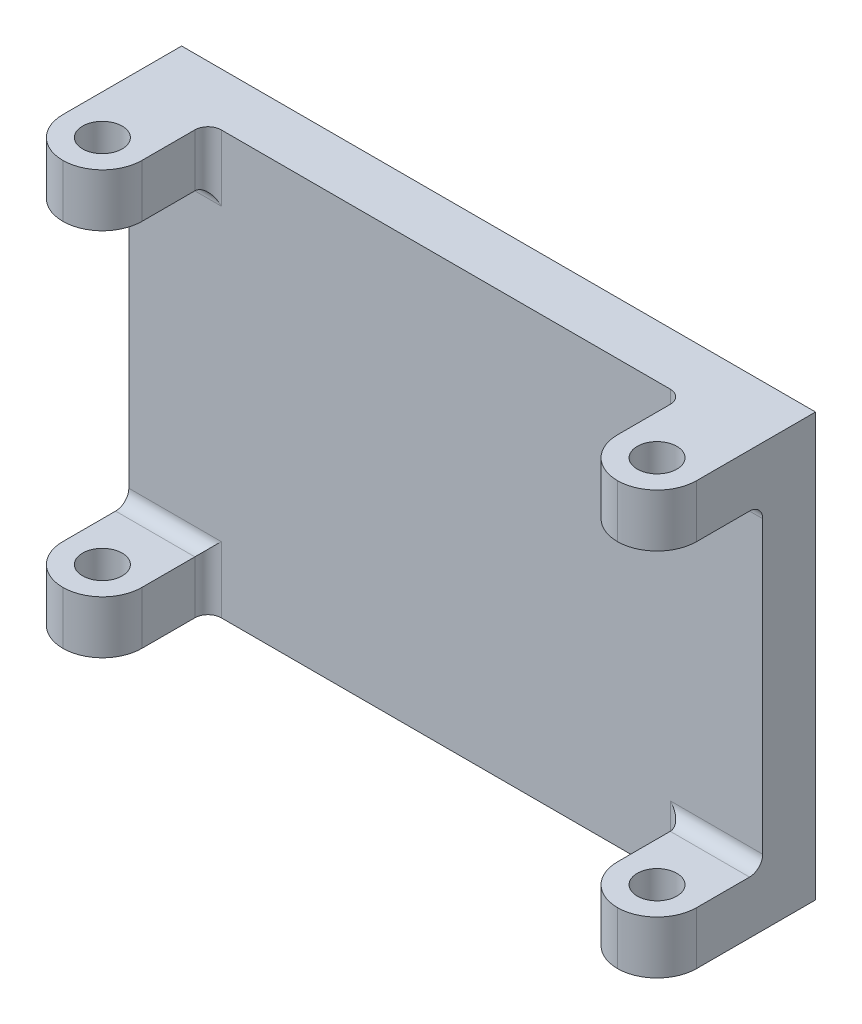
ISO-10303-21;
HEADER;
FILE_DESCRIPTION(('STEP AP214'),'2;1');
FILE_NAME('part.step','',(''),(''),'','','');
FILE_SCHEMA(('AUTOMOTIVE_DESIGN { 1 0 10303 214 1 1 1 1 }'));
ENDSEC;
DATA;
#1=APPLICATION_CONTEXT('core data for automotive mechanical design processes');
#2=APPLICATION_PROTOCOL_DEFINITION('international standard','automotive_design',2000,#1);
#3=PRODUCT_CONTEXT('',#1,'mechanical');
#4=PRODUCT('Part','Part','',(#3));
#5=PRODUCT_RELATED_PRODUCT_CATEGORY('part','',(#4));
#6=PRODUCT_DEFINITION_FORMATION('','',#4);
#7=PRODUCT_DEFINITION_CONTEXT('part definition',#1,'design');
#8=PRODUCT_DEFINITION('design','',#6,#7);
#9=PRODUCT_DEFINITION_SHAPE('','',#8);
#10=(LENGTH_UNIT() NAMED_UNIT(*) SI_UNIT(.MILLI.,.METRE.));
#11=(NAMED_UNIT(*) PLANE_ANGLE_UNIT() SI_UNIT($,.RADIAN.));
#12=(NAMED_UNIT(*) SI_UNIT($,.STERADIAN.) SOLID_ANGLE_UNIT());
#13=UNCERTAINTY_MEASURE_WITH_UNIT(LENGTH_MEASURE(1.E-05),#10,'distance_accuracy_value','');
#14=(GEOMETRIC_REPRESENTATION_CONTEXT(3) GLOBAL_UNCERTAINTY_ASSIGNED_CONTEXT((#13)) GLOBAL_UNIT_ASSIGNED_CONTEXT((#10,
#11,#12)) REPRESENTATION_CONTEXT('',''));
#15=CARTESIAN_POINT('',(0.,0.,0.));
#16=DIRECTION('',(0.,0.,1.));
#17=DIRECTION('',(1.,0.,0.));
#18=AXIS2_PLACEMENT_3D('',#15,#16,#17);
#19=CARTESIAN_POINT('',(-152.4,-101.6,25.4));
#20=DIRECTION('',(0.,0.,-1.));
#21=DIRECTION('',(-1.,0.,0.));
#22=AXIS2_PLACEMENT_3D('',#19,#20,#21);
#23=PLANE('',#22);
#24=DIRECTION('',(0.,1.,0.));
#25=VECTOR('',#24,1.);
#26=CARTESIAN_POINT('',(152.4,-101.6,25.4));
#27=LINE('',#26,#25);
#28=CARTESIAN_POINT('',(152.4,-69.85,25.4));
#29=VERTEX_POINT('',#28);
#30=CARTESIAN_POINT('',(152.4,69.85,25.4));
#31=VERTEX_POINT('',#30);
#32=EDGE_CURVE('E352',#29,#31,#27,.T.);
#33=ORIENTED_EDGE('',*,*,#32,.T.);
#34=DIRECTION('',(1.,0.,0.));
#35=VECTOR('',#34,1.);
#36=CARTESIAN_POINT('',(114.3,69.85,25.4));
#37=LINE('',#36,#35);
#38=CARTESIAN_POINT('',(107.95,69.85,25.4));
#39=VERTEX_POINT('',#38);
#40=EDGE_CURVE('E381',#31,#39,#37,.F.);
#41=ORIENTED_EDGE('',*,*,#40,.T.);
#42=DIRECTION('',(0.,-1.,0.));
#43=VECTOR('',#42,1.);
#44=CARTESIAN_POINT('',(107.95,101.6,25.4));
#45=LINE('',#44,#43);
#46=CARTESIAN_POINT('',(107.95,101.6,25.4));
#47=VERTEX_POINT('',#46);
#48=EDGE_CURVE('E373',#39,#47,#45,.F.);
#49=ORIENTED_EDGE('',*,*,#48,.T.);
#50=DIRECTION('',(-1.,0.,0.));
#51=VECTOR('',#50,1.);
#52=CARTESIAN_POINT('',(-152.4,101.6,25.4));
#53=LINE('',#52,#51);
#54=CARTESIAN_POINT('',(-107.95,101.6,25.4));
#55=VERTEX_POINT('',#54);
#56=EDGE_CURVE('E240',#47,#55,#53,.T.);
#57=ORIENTED_EDGE('',*,*,#56,.T.);
#58=DIRECTION('',(0.,-1.,0.));
#59=VECTOR('',#58,1.);
#60=CARTESIAN_POINT('',(-107.95,-101.6,25.4));
#61=LINE('',#60,#59);
#62=CARTESIAN_POINT('',(-107.95,69.85,25.4));
#63=VERTEX_POINT('',#62);
#64=EDGE_CURVE('E376',#55,#63,#61,.T.);
#65=ORIENTED_EDGE('',*,*,#64,.T.);
#66=DIRECTION('',(-1.,0.,0.));
#67=VECTOR('',#66,1.);
#68=CARTESIAN_POINT('',(-152.4,69.85,25.4));
#69=LINE('',#68,#67);
#70=CARTESIAN_POINT('',(-152.4,69.85,25.4));
#71=VERTEX_POINT('',#70);
#72=EDGE_CURVE('E371',#63,#71,#69,.T.);
#73=ORIENTED_EDGE('',*,*,#72,.T.);
#74=DIRECTION('',(0.,-1.,0.));
#75=VECTOR('',#74,1.);
#76=CARTESIAN_POINT('',(-152.4,-101.6,25.4));
#77=LINE('',#76,#75);
#78=CARTESIAN_POINT('',(-152.4,-69.85,25.4));
#79=VERTEX_POINT('',#78);
#80=EDGE_CURVE('E246',#71,#79,#77,.T.);
#81=ORIENTED_EDGE('',*,*,#80,.T.);
#82=DIRECTION('',(-1.,0.,0.));
#83=VECTOR('',#82,1.);
#84=CARTESIAN_POINT('',(-114.3,-69.85,25.4));
#85=LINE('',#84,#83);
#86=CARTESIAN_POINT('',(-107.95,-69.85,25.4));
#87=VERTEX_POINT('',#86);
#88=EDGE_CURVE('E458',#79,#87,#85,.F.);
#89=ORIENTED_EDGE('',*,*,#88,.T.);
#90=DIRECTION('',(0.,1.,0.));
#91=VECTOR('',#90,1.);
#92=CARTESIAN_POINT('',(-107.95,-101.6,25.4));
#93=LINE('',#92,#91);
#94=CARTESIAN_POINT('',(-107.95,-101.6,25.4));
#95=VERTEX_POINT('',#94);
#96=EDGE_CURVE('E341',#87,#95,#93,.F.);
#97=ORIENTED_EDGE('',*,*,#96,.T.);
#98=DIRECTION('',(1.,0.,0.));
#99=VECTOR('',#98,1.);
#100=CARTESIAN_POINT('',(-152.4,-101.6,25.4));
#101=LINE('',#100,#99);
#102=CARTESIAN_POINT('',(107.95,-101.6,25.4));
#103=VERTEX_POINT('',#102);
#104=EDGE_CURVE('E345',#95,#103,#101,.T.);
#105=ORIENTED_EDGE('',*,*,#104,.T.);
#106=DIRECTION('',(0.,1.,0.));
#107=VECTOR('',#106,1.);
#108=CARTESIAN_POINT('',(107.95,-101.6,25.4));
#109=LINE('',#108,#107);
#110=CARTESIAN_POINT('',(107.95,-69.85,25.4));
#111=VERTEX_POINT('',#110);
#112=EDGE_CURVE('E361',#103,#111,#109,.T.);
#113=ORIENTED_EDGE('',*,*,#112,.T.);
#114=DIRECTION('',(1.,0.,0.));
#115=VECTOR('',#114,1.);
#116=CARTESIAN_POINT('',(-152.4,-69.85,25.4));
#117=LINE('',#116,#115);
#118=EDGE_CURVE('E370',#111,#29,#117,.T.);
#119=ORIENTED_EDGE('',*,*,#118,.T.);
#120=EDGE_LOOP('',(#33,#41,#49,#57,#65,#73,#81,#89,#97,#105,#113,#119));
#121=FACE_BOUND('',#120,.T.);
#122=ADVANCED_FACE('F31',(#121),#23,.F.);
#123=CARTESIAN_POINT('',(-152.4,101.6,25.4));
#124=DIRECTION('',(0.,-1.,0.));
#125=DIRECTION('',(1.,0.,0.));
#126=AXIS2_PLACEMENT_3D('',#123,#124,#125);
#127=PLANE('',#126);
#128=CARTESIAN_POINT('',(133.35,101.6,57.15));
#129=DIRECTION('',(0.,1.,0.));
#130=DIRECTION('',(-1.,0.,0.));
#131=AXIS2_PLACEMENT_3D('',#128,#129,#130);
#132=CIRCLE('',#131,9.52500000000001);
#133=CARTESIAN_POINT('',(123.825,101.6,57.15));
#134=VERTEX_POINT('',#133);
#135=EDGE_CURVE('E338',#134,#134,#132,.T.);
#136=ORIENTED_EDGE('',*,*,#135,.F.);
#137=EDGE_LOOP('',(#136));
#138=FACE_BOUND('',#137,.T.);
#139=DIRECTION('',(0.,0.,-1.));
#140=VECTOR('',#139,1.);
#141=CARTESIAN_POINT('',(114.3,101.6,76.2));
#142=LINE('',#141,#140);
#143=CARTESIAN_POINT('',(114.3,101.6,57.15));
#144=VERTEX_POINT('',#143);
#145=CARTESIAN_POINT('',(114.3,101.6,31.75));
#146=VERTEX_POINT('',#145);
#147=EDGE_CURVE('E439',#144,#146,#142,.T.);
#148=ORIENTED_EDGE('',*,*,#147,.F.);
#149=CARTESIAN_POINT('',(133.35,101.6,57.15));
#150=DIRECTION('',(0.,-1.,0.));
#151=DIRECTION('',(1.,0.,0.));
#152=AXIS2_PLACEMENT_3D('',#149,#150,#151);
#153=CIRCLE('',#152,19.05);
#154=CARTESIAN_POINT('',(133.35,101.6,76.2));
#155=VERTEX_POINT('',#154);
#156=EDGE_CURVE('E326',#144,#155,#153,.F.);
#157=ORIENTED_EDGE('',*,*,#156,.T.);
#158=CARTESIAN_POINT('',(133.35,101.6,57.15));
#159=DIRECTION('',(0.,-1.,0.));
#160=DIRECTION('',(1.,0.,0.));
#161=AXIS2_PLACEMENT_3D('',#158,#159,#160);
#162=CIRCLE('',#161,19.05);
#163=CARTESIAN_POINT('',(152.4,101.6,57.15));
#164=VERTEX_POINT('',#163);
#165=EDGE_CURVE('E324',#155,#164,#162,.F.);
#166=ORIENTED_EDGE('',*,*,#165,.T.);
#167=DIRECTION('',(0.,0.,-1.));
#168=VECTOR('',#167,1.);
#169=CARTESIAN_POINT('',(152.4,101.6,25.4));
#170=LINE('',#169,#168);
#171=CARTESIAN_POINT('',(152.4,101.6,0.));
#172=VERTEX_POINT('',#171);
#173=EDGE_CURVE('E248',#164,#172,#170,.T.);
#174=ORIENTED_EDGE('',*,*,#173,.T.);
#175=DIRECTION('',(-1.,0.,0.));
#176=VECTOR('',#175,1.);
#177=CARTESIAN_POINT('',(-152.4,101.6,0.));
#178=LINE('',#177,#176);
#179=CARTESIAN_POINT('',(-152.4,101.6,0.));
#180=VERTEX_POINT('',#179);
#181=EDGE_CURVE('E244',#172,#180,#178,.T.);
#182=ORIENTED_EDGE('',*,*,#181,.T.);
#183=DIRECTION('',(0.,0.,-1.));
#184=VECTOR('',#183,1.);
#185=CARTESIAN_POINT('',(-152.4,101.6,25.4));
#186=LINE('',#185,#184);
#187=CARTESIAN_POINT('',(-152.4,101.6,57.15));
#188=VERTEX_POINT('',#187);
#189=EDGE_CURVE('E233',#188,#180,#186,.T.);
#190=ORIENTED_EDGE('',*,*,#189,.F.);
#191=CARTESIAN_POINT('',(-133.35,101.6,57.15));
#192=DIRECTION('',(0.,-1.,0.));
#193=DIRECTION('',(1.,0.,0.));
#194=AXIS2_PLACEMENT_3D('',#191,#192,#193);
#195=CIRCLE('',#194,19.05);
#196=CARTESIAN_POINT('',(-133.35,101.6,76.2));
#197=VERTEX_POINT('',#196);
#198=EDGE_CURVE('E303',#188,#197,#195,.F.);
#199=ORIENTED_EDGE('',*,*,#198,.T.);
#200=CARTESIAN_POINT('',(-133.35,101.6,57.15));
#201=DIRECTION('',(0.,-1.,0.));
#202=DIRECTION('',(1.,0.,0.));
#203=AXIS2_PLACEMENT_3D('',#200,#201,#202);
#204=CIRCLE('',#203,19.05);
#205=CARTESIAN_POINT('',(-114.3,101.6,57.15));
#206=VERTEX_POINT('',#205);
#207=EDGE_CURVE('E305',#197,#206,#204,.F.);
#208=ORIENTED_EDGE('',*,*,#207,.T.);
#209=DIRECTION('',(0.,0.,-1.));
#210=VECTOR('',#209,1.);
#211=CARTESIAN_POINT('',(-114.3,101.6,76.2));
#212=LINE('',#211,#210);
#213=CARTESIAN_POINT('',(-114.3,101.6,31.75));
#214=VERTEX_POINT('',#213);
#215=EDGE_CURVE('E313',#206,#214,#212,.T.);
#216=ORIENTED_EDGE('',*,*,#215,.T.);
#217=CARTESIAN_POINT('',(-107.95,101.6,31.75));
#218=DIRECTION('',(0.,-1.,0.));
#219=DIRECTION('',(1.,0.,0.));
#220=AXIS2_PLACEMENT_3D('',#217,#218,#219);
#221=CIRCLE('',#220,6.35);
#222=EDGE_CURVE('E40',#214,#55,#221,.T.);
#223=ORIENTED_EDGE('',*,*,#222,.T.);
#224=ORIENTED_EDGE('',*,*,#56,.F.);
#225=CARTESIAN_POINT('',(107.95,101.6,31.75));
#226=DIRECTION('',(0.,-1.,0.));
#227=DIRECTION('',(1.,0.,0.));
#228=AXIS2_PLACEMENT_3D('',#225,#226,#227);
#229=CIRCLE('',#228,6.35);
#230=EDGE_CURVE('E405',#47,#146,#229,.T.);
#231=ORIENTED_EDGE('',*,*,#230,.T.);
#232=EDGE_LOOP('',(#148,#157,#166,#174,#182,#190,#199,#208,#216,#223,#224,#231));
#233=FACE_BOUND('',#232,.T.);
#234=CARTESIAN_POINT('',(-133.35,101.6,57.15));
#235=DIRECTION('',(0.,-1.,0.));
#236=DIRECTION('',(1.,0.,0.));
#237=AXIS2_PLACEMENT_3D('',#234,#235,#236);
#238=CIRCLE('',#237,9.52500000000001);
#239=CARTESIAN_POINT('',(-123.825,101.6,57.15));
#240=VERTEX_POINT('',#239);
#241=EDGE_CURVE('E317',#240,#240,#238,.T.);
#242=ORIENTED_EDGE('',*,*,#241,.T.);
#243=EDGE_LOOP('',(#242));
#244=FACE_BOUND('',#243,.T.);
#245=ADVANCED_FACE('F450',(#138,#233,#244),#127,.F.);
#246=CARTESIAN_POINT('',(-152.4,76.2,76.2));
#247=DIRECTION('',(0.,-1.,0.));
#248=DIRECTION('',(0.,0.,-1.));
#249=AXIS2_PLACEMENT_3D('',#246,#247,#248);
#250=PLANE('',#249);
#251=DIRECTION('',(0.,0.,-1.));
#252=VECTOR('',#251,1.);
#253=CARTESIAN_POINT('',(-152.4,76.2,76.2));
#254=LINE('',#253,#252);
#255=CARTESIAN_POINT('',(-152.4,76.2,57.15));
#256=VERTEX_POINT('',#255);
#257=CARTESIAN_POINT('',(-152.4,76.2,31.75));
#258=VERTEX_POINT('',#257);
#259=EDGE_CURVE('E547',#256,#258,#254,.T.);
#260=ORIENTED_EDGE('',*,*,#259,.T.);
#261=DIRECTION('',(-1.,0.,0.));
#262=VECTOR('',#261,1.);
#263=CARTESIAN_POINT('',(-152.4,76.2,31.75));
#264=LINE('',#263,#262);
#265=CARTESIAN_POINT('',(-114.3,76.2,31.75));
#266=VERTEX_POINT('',#265);
#267=EDGE_CURVE('E383',#258,#266,#264,.F.);
#268=ORIENTED_EDGE('',*,*,#267,.T.);
#269=DIRECTION('',(0.,0.,-1.));
#270=VECTOR('',#269,1.);
#271=CARTESIAN_POINT('',(-114.3,76.2,76.2));
#272=LINE('',#271,#270);
#273=CARTESIAN_POINT('',(-114.3,76.2,57.15));
#274=VERTEX_POINT('',#273);
#275=EDGE_CURVE('E550',#274,#266,#272,.T.);
#276=ORIENTED_EDGE('',*,*,#275,.F.);
#277=CARTESIAN_POINT('',(-133.35,76.2,57.15));
#278=DIRECTION('',(0.,-1.,0.));
#279=DIRECTION('',(0.,0.,-1.));
#280=AXIS2_PLACEMENT_3D('',#277,#278,#279);
#281=CIRCLE('',#280,19.05);
#282=CARTESIAN_POINT('',(-133.35,76.2,76.2));
#283=VERTEX_POINT('',#282);
#284=EDGE_CURVE('E301',#274,#283,#281,.T.);
#285=ORIENTED_EDGE('',*,*,#284,.T.);
#286=CARTESIAN_POINT('',(-133.35,76.2,57.15));
#287=DIRECTION('',(0.,-1.,0.));
#288=DIRECTION('',(0.,0.,-1.));
#289=AXIS2_PLACEMENT_3D('',#286,#287,#288);
#290=CIRCLE('',#289,19.05);
#291=EDGE_CURVE('E299',#283,#256,#290,.T.);
#292=ORIENTED_EDGE('',*,*,#291,.T.);
#293=EDGE_LOOP('',(#260,#268,#276,#285,#292));
#294=FACE_BOUND('',#293,.T.);
#295=CARTESIAN_POINT('',(-133.35,76.2,57.15));
#296=DIRECTION('',(0.,-1.,0.));
#297=DIRECTION('',(0.,0.,-1.));
#298=AXIS2_PLACEMENT_3D('',#295,#296,#297);
#299=CIRCLE('',#298,9.52500000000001);
#300=CARTESIAN_POINT('',(-133.35,76.2,47.625));
#301=VERTEX_POINT('',#300);
#302=EDGE_CURVE('E314',#301,#301,#299,.F.);
#303=ORIENTED_EDGE('',*,*,#302,.T.);
#304=EDGE_LOOP('',(#303));
#305=FACE_BOUND('',#304,.T.);
#306=ADVANCED_FACE('F501',(#294,#305),#250,.T.);
#307=CARTESIAN_POINT('',(-152.4,-101.6,25.4));
#308=DIRECTION('',(0.,1.,0.));
#309=DIRECTION('',(-1.,0.,0.));
#310=AXIS2_PLACEMENT_3D('',#307,#308,#309);
#311=PLANE('',#310);
#312=CARTESIAN_POINT('',(133.35,-101.6,57.15));
#313=DIRECTION('',(0.,1.,0.));
#314=DIRECTION('',(-1.,0.,0.));
#315=AXIS2_PLACEMENT_3D('',#312,#313,#314);
#316=CIRCLE('',#315,19.05);
#317=CARTESIAN_POINT('',(152.4,-101.6,57.15));
#318=VERTEX_POINT('',#317);
#319=CARTESIAN_POINT('',(133.35,-101.6,76.2));
#320=VERTEX_POINT('',#319);
#321=EDGE_CURVE('E282',#318,#320,#316,.F.);
#322=ORIENTED_EDGE('',*,*,#321,.T.);
#323=CARTESIAN_POINT('',(133.35,-101.6,57.15));
#324=DIRECTION('',(0.,1.,0.));
#325=DIRECTION('',(-1.,0.,0.));
#326=AXIS2_PLACEMENT_3D('',#323,#324,#325);
#327=CIRCLE('',#326,19.05);
#328=CARTESIAN_POINT('',(114.3,-101.6,57.15));
#329=VERTEX_POINT('',#328);
#330=EDGE_CURVE('E284',#320,#329,#327,.F.);
#331=ORIENTED_EDGE('',*,*,#330,.T.);
#332=DIRECTION('',(0.,0.,-1.));
#333=VECTOR('',#332,1.);
#334=CARTESIAN_POINT('',(114.3,-101.6,76.2));
#335=LINE('',#334,#333);
#336=CARTESIAN_POINT('',(114.3,-101.6,31.75));
#337=VERTEX_POINT('',#336);
#338=EDGE_CURVE('E292',#329,#337,#335,.T.);
#339=ORIENTED_EDGE('',*,*,#338,.T.);
#340=CARTESIAN_POINT('',(107.95,-101.6,31.75));
#341=DIRECTION('',(0.,1.,0.));
#342=DIRECTION('',(-1.,0.,0.));
#343=AXIS2_PLACEMENT_3D('',#340,#341,#342);
#344=CIRCLE('',#343,6.35);
#345=EDGE_CURVE('E367',#337,#103,#344,.T.);
#346=ORIENTED_EDGE('',*,*,#345,.T.);
#347=ORIENTED_EDGE('',*,*,#104,.F.);
#348=CARTESIAN_POINT('',(-107.95,-101.6,31.75));
#349=DIRECTION('',(0.,1.,0.));
#350=DIRECTION('',(-1.,0.,0.));
#351=AXIS2_PLACEMENT_3D('',#348,#349,#350);
#352=CIRCLE('',#351,6.35);
#353=CARTESIAN_POINT('',(-114.3,-101.6,31.75));
#354=VERTEX_POINT('',#353);
#355=EDGE_CURVE('E11',#95,#354,#352,.T.);
#356=ORIENTED_EDGE('',*,*,#355,.T.);
#357=DIRECTION('',(0.,0.,-1.));
#358=VECTOR('',#357,1.);
#359=CARTESIAN_POINT('',(-114.3,-101.6,76.2));
#360=LINE('',#359,#358);
#361=CARTESIAN_POINT('',(-114.3,-101.6,57.15));
#362=VERTEX_POINT('',#361);
#363=EDGE_CURVE('E235',#362,#354,#360,.T.);
#364=ORIENTED_EDGE('',*,*,#363,.F.);
#365=CARTESIAN_POINT('',(-133.35,-101.6,57.15));
#366=DIRECTION('',(0.,1.,0.));
#367=DIRECTION('',(-1.,0.,0.));
#368=AXIS2_PLACEMENT_3D('',#365,#366,#367);
#369=CIRCLE('',#368,19.05);
#370=CARTESIAN_POINT('',(-133.35,-101.6,76.2));
#371=VERTEX_POINT('',#370);
#372=EDGE_CURVE('E263',#362,#371,#369,.F.);
#373=ORIENTED_EDGE('',*,*,#372,.T.);
#374=CARTESIAN_POINT('',(-133.35,-101.6,57.15));
#375=DIRECTION('',(0.,1.,0.));
#376=DIRECTION('',(-1.,0.,0.));
#377=AXIS2_PLACEMENT_3D('',#374,#375,#376);
#378=CIRCLE('',#377,19.05);
#379=CARTESIAN_POINT('',(-152.4,-101.6,57.15));
#380=VERTEX_POINT('',#379);
#381=EDGE_CURVE('E215',#371,#380,#378,.F.);
#382=ORIENTED_EDGE('',*,*,#381,.T.);
#383=DIRECTION('',(0.,0.,-1.));
#384=VECTOR('',#383,1.);
#385=CARTESIAN_POINT('',(-152.4,-101.6,25.4));
#386=LINE('',#385,#384);
#387=CARTESIAN_POINT('',(-152.4,-101.6,0.));
#388=VERTEX_POINT('',#387);
#389=EDGE_CURVE('E207',#380,#388,#386,.T.);
#390=ORIENTED_EDGE('',*,*,#389,.T.);
#391=DIRECTION('',(1.,0.,0.));
#392=VECTOR('',#391,1.);
#393=CARTESIAN_POINT('',(-152.4,-101.6,0.));
#394=LINE('',#393,#392);
#395=CARTESIAN_POINT('',(152.4,-101.6,0.));
#396=VERTEX_POINT('',#395);
#397=EDGE_CURVE('E212',#388,#396,#394,.T.);
#398=ORIENTED_EDGE('',*,*,#397,.T.);
#399=DIRECTION('',(0.,0.,-1.));
#400=VECTOR('',#399,1.);
#401=CARTESIAN_POINT('',(152.4,-101.6,25.4));
#402=LINE('',#401,#400);
#403=EDGE_CURVE('E220',#318,#396,#402,.T.);
#404=ORIENTED_EDGE('',*,*,#403,.F.);
#405=EDGE_LOOP('',(#322,#331,#339,#346,#347,#356,#364,#373,#382,#390,#398,#404));
#406=FACE_BOUND('',#405,.T.);
#407=CARTESIAN_POINT('',(-133.35,-101.6,57.15));
#408=DIRECTION('',(0.,-1.,0.));
#409=DIRECTION('',(1.,0.,0.));
#410=AXIS2_PLACEMENT_3D('',#407,#408,#409);
#411=CIRCLE('',#410,9.52500000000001);
#412=CARTESIAN_POINT('',(-123.825,-101.6,57.15));
#413=VERTEX_POINT('',#412);
#414=EDGE_CURVE('E275',#413,#413,#411,.T.);
#415=ORIENTED_EDGE('',*,*,#414,.F.);
#416=EDGE_LOOP('',(#415));
#417=FACE_BOUND('',#416,.T.);
#418=CARTESIAN_POINT('',(133.35,-101.6,57.15));
#419=DIRECTION('',(0.,1.,0.));
#420=DIRECTION('',(-1.,0.,0.));
#421=AXIS2_PLACEMENT_3D('',#418,#419,#420);
#422=CIRCLE('',#421,9.52500000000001);
#423=CARTESIAN_POINT('',(123.825,-101.6,57.15));
#424=VERTEX_POINT('',#423);
#425=EDGE_CURVE('E296',#424,#424,#422,.T.);
#426=ORIENTED_EDGE('',*,*,#425,.T.);
#427=EDGE_LOOP('',(#426));
#428=FACE_BOUND('',#427,.T.);
#429=ADVANCED_FACE('F209',(#406,#417,#428),#311,.F.);
#430=CARTESIAN_POINT('',(152.4,-76.2,76.2));
#431=DIRECTION('',(0.,1.,0.));
#432=DIRECTION('',(0.,0.,1.));
#433=AXIS2_PLACEMENT_3D('',#430,#431,#432);
#434=PLANE('',#433);
#435=DIRECTION('',(0.,0.,-1.));
#436=VECTOR('',#435,1.);
#437=CARTESIAN_POINT('',(152.4,-76.2,76.2));
#438=LINE('',#437,#436);
#439=CARTESIAN_POINT('',(152.4,-76.2,57.15));
#440=VERTEX_POINT('',#439);
#441=CARTESIAN_POINT('',(152.4,-76.2,31.75));
#442=VERTEX_POINT('',#441);
#443=EDGE_CURVE('E537',#440,#442,#438,.T.);
#444=ORIENTED_EDGE('',*,*,#443,.T.);
#445=DIRECTION('',(1.,0.,0.));
#446=VECTOR('',#445,1.);
#447=CARTESIAN_POINT('',(152.4,-76.2,31.75));
#448=LINE('',#447,#446);
#449=CARTESIAN_POINT('',(114.3,-76.2,31.75));
#450=VERTEX_POINT('',#449);
#451=EDGE_CURVE('E388',#442,#450,#448,.F.);
#452=ORIENTED_EDGE('',*,*,#451,.T.);
#453=DIRECTION('',(0.,0.,-1.));
#454=VECTOR('',#453,1.);
#455=CARTESIAN_POINT('',(114.3,-76.2,76.2));
#456=LINE('',#455,#454);
#457=CARTESIAN_POINT('',(114.3,-76.2,57.15));
#458=VERTEX_POINT('',#457);
#459=EDGE_CURVE('E538',#458,#450,#456,.T.);
#460=ORIENTED_EDGE('',*,*,#459,.F.);
#461=CARTESIAN_POINT('',(133.35,-76.2,57.15));
#462=DIRECTION('',(0.,1.,0.));
#463=DIRECTION('',(0.,0.,1.));
#464=AXIS2_PLACEMENT_3D('',#461,#462,#463);
#465=CIRCLE('',#464,19.05);
#466=CARTESIAN_POINT('',(133.35,-76.2,76.2));
#467=VERTEX_POINT('',#466);
#468=EDGE_CURVE('E280',#458,#467,#465,.T.);
#469=ORIENTED_EDGE('',*,*,#468,.T.);
#470=CARTESIAN_POINT('',(133.35,-76.2,57.15));
#471=DIRECTION('',(0.,1.,0.));
#472=DIRECTION('',(0.,0.,1.));
#473=AXIS2_PLACEMENT_3D('',#470,#471,#472);
#474=CIRCLE('',#473,19.05);
#475=EDGE_CURVE('E278',#467,#440,#474,.T.);
#476=ORIENTED_EDGE('',*,*,#475,.T.);
#477=EDGE_LOOP('',(#444,#452,#460,#469,#476));
#478=FACE_BOUND('',#477,.T.);
#479=CARTESIAN_POINT('',(133.35,-76.2,57.15));
#480=DIRECTION('',(0.,1.,0.));
#481=DIRECTION('',(0.,0.,1.));
#482=AXIS2_PLACEMENT_3D('',#479,#480,#481);
#483=CIRCLE('',#482,9.52500000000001);
#484=CARTESIAN_POINT('',(133.35,-76.2,66.675));
#485=VERTEX_POINT('',#484);
#486=EDGE_CURVE('E293',#485,#485,#483,.F.);
#487=ORIENTED_EDGE('',*,*,#486,.T.);
#488=EDGE_LOOP('',(#487));
#489=FACE_BOUND('',#488,.T.);
#490=ADVANCED_FACE('F512',(#478,#489),#434,.T.);
#491=CARTESIAN_POINT('',(-152.4,-101.6,25.4));
#492=DIRECTION('',(1.,0.,0.));
#493=DIRECTION('',(0.,0.,-1.));
#494=AXIS2_PLACEMENT_3D('',#491,#492,#493);
#495=PLANE('',#494);
#496=ORIENTED_EDGE('',*,*,#259,.F.);
#497=DIRECTION('',(0.,1.,0.));
#498=VECTOR('',#497,1.);
#499=CARTESIAN_POINT('',(-152.4,-101.6,57.15));
#500=LINE('',#499,#498);
#501=EDGE_CURVE('E307',#256,#188,#500,.T.);
#502=ORIENTED_EDGE('',*,*,#501,.T.);
#503=ORIENTED_EDGE('',*,*,#189,.T.);
#504=DIRECTION('',(0.,-1.,0.));
#505=VECTOR('',#504,1.);
#506=CARTESIAN_POINT('',(-152.4,-101.6,0.));
#507=LINE('',#506,#505);
#508=EDGE_CURVE('E226',#180,#388,#507,.T.);
#509=ORIENTED_EDGE('',*,*,#508,.T.);
#510=ORIENTED_EDGE('',*,*,#389,.F.);
#511=DIRECTION('',(0.,-1.,0.));
#512=VECTOR('',#511,1.);
#513=CARTESIAN_POINT('',(-152.4,-101.6,57.15));
#514=LINE('',#513,#512);
#515=CARTESIAN_POINT('',(-152.4,-76.2,57.15));
#516=VERTEX_POINT('',#515);
#517=EDGE_CURVE('E265',#380,#516,#514,.F.);
#518=ORIENTED_EDGE('',*,*,#517,.T.);
#519=DIRECTION('',(0.,0.,-1.));
#520=VECTOR('',#519,1.);
#521=CARTESIAN_POINT('',(-152.4,-76.2,76.2));
#522=LINE('',#521,#520);
#523=CARTESIAN_POINT('',(-152.4,-76.2,31.75));
#524=VERTEX_POINT('',#523);
#525=EDGE_CURVE('E271',#516,#524,#522,.T.);
#526=ORIENTED_EDGE('',*,*,#525,.T.);
#527=CARTESIAN_POINT('',(-152.4,-69.85,31.75));
#528=DIRECTION('',(1.,0.,0.));
#529=DIRECTION('',(0.,0.,-1.));
#530=AXIS2_PLACEMENT_3D('',#527,#528,#529);
#531=CIRCLE('',#530,6.35);
#532=EDGE_CURVE('E397',#524,#79,#531,.T.);
#533=ORIENTED_EDGE('',*,*,#532,.T.);
#534=ORIENTED_EDGE('',*,*,#80,.F.);
#535=CARTESIAN_POINT('',(-152.4,69.85,31.75));
#536=DIRECTION('',(1.,0.,0.));
#537=DIRECTION('',(0.,0.,-1.));
#538=AXIS2_PLACEMENT_3D('',#535,#536,#537);
#539=CIRCLE('',#538,6.35);
#540=EDGE_CURVE('E399',#71,#258,#539,.T.);
#541=ORIENTED_EDGE('',*,*,#540,.T.);
#542=EDGE_LOOP('',(#496,#502,#503,#509,#510,#518,#526,#533,#534,#541));
#543=FACE_BOUND('',#542,.T.);
#544=ADVANCED_FACE('F231',(#543),#495,.F.);
#545=CARTESIAN_POINT('',(152.4,-101.6,25.4));
#546=DIRECTION('',(-1.,0.,0.));
#547=DIRECTION('',(0.,0.,1.));
#548=AXIS2_PLACEMENT_3D('',#545,#546,#547);
#549=PLANE('',#548);
#550=ORIENTED_EDGE('',*,*,#173,.F.);
#551=DIRECTION('',(0.,1.,0.));
#552=VECTOR('',#551,1.);
#553=CARTESIAN_POINT('',(152.4,-101.6,57.15));
#554=LINE('',#553,#552);
#555=CARTESIAN_POINT('',(152.4,76.2,57.15));
#556=VERTEX_POINT('',#555);
#557=EDGE_CURVE('E328',#164,#556,#554,.F.);
#558=ORIENTED_EDGE('',*,*,#557,.T.);
#559=DIRECTION('',(0.,0.,-1.));
#560=VECTOR('',#559,1.);
#561=CARTESIAN_POINT('',(152.4,76.2,76.2));
#562=LINE('',#561,#560);
#563=CARTESIAN_POINT('',(152.4,76.2,31.75));
#564=VERTEX_POINT('',#563);
#565=EDGE_CURVE('E334',#556,#564,#562,.T.);
#566=ORIENTED_EDGE('',*,*,#565,.T.);
#567=CARTESIAN_POINT('',(152.4,69.85,31.75));
#568=DIRECTION('',(-1.,0.,0.));
#569=DIRECTION('',(0.,0.,1.));
#570=AXIS2_PLACEMENT_3D('',#567,#568,#569);
#571=CIRCLE('',#570,6.35);
#572=EDGE_CURVE('E401',#564,#31,#571,.T.);
#573=ORIENTED_EDGE('',*,*,#572,.T.);
#574=ORIENTED_EDGE('',*,*,#32,.F.);
#575=CARTESIAN_POINT('',(152.4,-69.85,31.75));
#576=DIRECTION('',(-1.,0.,0.));
#577=DIRECTION('',(0.,0.,1.));
#578=AXIS2_PLACEMENT_3D('',#575,#576,#577);
#579=CIRCLE('',#578,6.35);
#580=EDGE_CURVE('E403',#29,#442,#579,.T.);
#581=ORIENTED_EDGE('',*,*,#580,.T.);
#582=ORIENTED_EDGE('',*,*,#443,.F.);
#583=DIRECTION('',(0.,-1.,0.));
#584=VECTOR('',#583,1.);
#585=CARTESIAN_POINT('',(152.4,-101.6,57.15));
#586=LINE('',#585,#584);
#587=EDGE_CURVE('E286',#440,#318,#586,.T.);
#588=ORIENTED_EDGE('',*,*,#587,.T.);
#589=ORIENTED_EDGE('',*,*,#403,.T.);
#590=DIRECTION('',(0.,1.,0.));
#591=VECTOR('',#590,1.);
#592=CARTESIAN_POINT('',(152.4,-101.6,0.));
#593=LINE('',#592,#591);
#594=EDGE_CURVE('E228',#396,#172,#593,.T.);
#595=ORIENTED_EDGE('',*,*,#594,.T.);
#596=EDGE_LOOP('',(#550,#558,#566,#573,#574,#581,#582,#588,#589,#595));
#597=FACE_BOUND('',#596,.T.);
#598=ADVANCED_FACE('F424',(#597),#549,.F.);
#599=CARTESIAN_POINT('',(-152.4,-101.6,0.));
#600=DIRECTION('',(0.,0.,-1.));
#601=DIRECTION('',(-1.,0.,0.));
#602=AXIS2_PLACEMENT_3D('',#599,#600,#601);
#603=PLANE('',#602);
#604=ORIENTED_EDGE('',*,*,#508,.F.);
#605=ORIENTED_EDGE('',*,*,#181,.F.);
#606=ORIENTED_EDGE('',*,*,#594,.F.);
#607=ORIENTED_EDGE('',*,*,#397,.F.);
#608=EDGE_LOOP('',(#604,#605,#606,#607));
#609=FACE_BOUND('',#608,.T.);
#610=ADVANCED_FACE('F224',(#609),#603,.T.);
#611=CARTESIAN_POINT('',(-114.3,-101.6,76.2));
#612=DIRECTION('',(-1.,0.,0.));
#613=DIRECTION('',(0.,0.,1.));
#614=AXIS2_PLACEMENT_3D('',#611,#612,#613);
#615=PLANE('',#614);
#616=ORIENTED_EDGE('',*,*,#363,.T.);
#617=DIRECTION('',(0.,1.,0.));
#618=VECTOR('',#617,1.);
#619=CARTESIAN_POINT('',(-114.3,-76.2,31.75));
#620=LINE('',#619,#618);
#621=CARTESIAN_POINT('',(-114.3,-76.2,31.75));
#622=VERTEX_POINT('',#621);
#623=EDGE_CURVE('E395',#354,#622,#620,.T.);
#624=ORIENTED_EDGE('',*,*,#623,.T.);
#625=DIRECTION('',(0.,0.,-1.));
#626=VECTOR('',#625,1.);
#627=CARTESIAN_POINT('',(-114.3,-76.2,76.2));
#628=LINE('',#627,#626);
#629=CARTESIAN_POINT('',(-114.3,-76.2,57.15));
#630=VERTEX_POINT('',#629);
#631=EDGE_CURVE('E237',#630,#622,#628,.T.);
#632=ORIENTED_EDGE('',*,*,#631,.F.);
#633=DIRECTION('',(0.,1.,0.));
#634=VECTOR('',#633,1.);
#635=CARTESIAN_POINT('',(-114.3,-101.6,57.15));
#636=LINE('',#635,#634);
#637=EDGE_CURVE('E259',#630,#362,#636,.F.);
#638=ORIENTED_EDGE('',*,*,#637,.T.);
#639=EDGE_LOOP('',(#616,#624,#632,#638));
#640=FACE_BOUND('',#639,.T.);
#641=ADVANCED_FACE('F481',(#640),#615,.F.);
#642=CARTESIAN_POINT('',(-152.4,-76.2,76.2));
#643=DIRECTION('',(0.,-1.,0.));
#644=DIRECTION('',(0.,0.,-1.));
#645=AXIS2_PLACEMENT_3D('',#642,#643,#644);
#646=PLANE('',#645);
#647=CARTESIAN_POINT('',(-133.35,-76.2,57.15));
#648=DIRECTION('',(0.,-1.,0.));
#649=DIRECTION('',(0.,0.,-1.));
#650=AXIS2_PLACEMENT_3D('',#647,#648,#649);
#651=CIRCLE('',#650,9.52500000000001);
#652=CARTESIAN_POINT('',(-133.35,-76.2,47.625));
#653=VERTEX_POINT('',#652);
#654=EDGE_CURVE('E272',#653,#653,#651,.T.);
#655=ORIENTED_EDGE('',*,*,#654,.T.);
#656=EDGE_LOOP('',(#655));
#657=FACE_BOUND('',#656,.T.);
#658=ORIENTED_EDGE('',*,*,#631,.T.);
#659=DIRECTION('',(-1.,0.,0.));
#660=VECTOR('',#659,1.);
#661=CARTESIAN_POINT('',(-152.4,-76.2,31.75));
#662=LINE('',#661,#660);
#663=EDGE_CURVE('E330',#622,#524,#662,.T.);
#664=ORIENTED_EDGE('',*,*,#663,.T.);
#665=ORIENTED_EDGE('',*,*,#525,.F.);
#666=CARTESIAN_POINT('',(-133.35,-76.2,57.15));
#667=DIRECTION('',(0.,-1.,0.));
#668=DIRECTION('',(0.,0.,-1.));
#669=AXIS2_PLACEMENT_3D('',#666,#667,#668);
#670=CIRCLE('',#669,19.05);
#671=CARTESIAN_POINT('',(-133.35,-76.2,76.2));
#672=VERTEX_POINT('',#671);
#673=EDGE_CURVE('E219',#516,#672,#670,.F.);
#674=ORIENTED_EDGE('',*,*,#673,.T.);
#675=CARTESIAN_POINT('',(-133.35,-76.2,57.15));
#676=DIRECTION('',(0.,-1.,0.));
#677=DIRECTION('',(0.,0.,-1.));
#678=AXIS2_PLACEMENT_3D('',#675,#676,#677);
#679=CIRCLE('',#678,19.05);
#680=EDGE_CURVE('E257',#672,#630,#679,.F.);
#681=ORIENTED_EDGE('',*,*,#680,.T.);
#682=EDGE_LOOP('',(#658,#664,#665,#674,#681));
#683=FACE_BOUND('',#682,.T.);
#684=ADVANCED_FACE('F473',(#657,#683),#646,.F.);
#685=CARTESIAN_POINT('',(-133.35,-76.2,57.15));
#686=DIRECTION('',(0.,-1.,0.));
#687=DIRECTION('',(0.,0.,-1.));
#688=AXIS2_PLACEMENT_3D('',#685,#686,#687);
#689=CYLINDRICAL_SURFACE('',#688,19.05);
#690=ORIENTED_EDGE('',*,*,#517,.F.);
#691=ORIENTED_EDGE('',*,*,#381,.F.);
#692=DIRECTION('',(0.,-1.,0.));
#693=VECTOR('',#692,1.);
#694=CARTESIAN_POINT('',(-133.35,-76.2,76.2));
#695=LINE('',#694,#693);
#696=EDGE_CURVE('E268',#672,#371,#695,.T.);
#697=ORIENTED_EDGE('',*,*,#696,.F.);
#698=ORIENTED_EDGE('',*,*,#673,.F.);
#699=EDGE_LOOP('',(#690,#691,#697,#698));
#700=FACE_BOUND('',#699,.T.);
#701=ADVANCED_FACE('F484',(#700),#689,.T.);
#702=CARTESIAN_POINT('',(-133.35,-76.2,57.15));
#703=DIRECTION('',(0.,1.,0.));
#704=DIRECTION('',(0.,0.,1.));
#705=AXIS2_PLACEMENT_3D('',#702,#703,#704);
#706=CYLINDRICAL_SURFACE('',#705,19.05);
#707=ORIENTED_EDGE('',*,*,#372,.F.);
#708=ORIENTED_EDGE('',*,*,#637,.F.);
#709=ORIENTED_EDGE('',*,*,#680,.F.);
#710=ORIENTED_EDGE('',*,*,#696,.T.);
#711=EDGE_LOOP('',(#707,#708,#709,#710));
#712=FACE_BOUND('',#711,.T.);
#713=ADVANCED_FACE('F482',(#712),#706,.T.);
#714=CARTESIAN_POINT('',(-133.35,101.600025,57.15));
#715=DIRECTION('',(0.,-1.,0.));
#716=DIRECTION('',(1.,0.,0.));
#717=AXIS2_PLACEMENT_3D('',#714,#715,#716);
#718=CYLINDRICAL_SURFACE('',#717,9.52500000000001);
#719=ORIENTED_EDGE('',*,*,#414,.T.);
#720=EDGE_LOOP('',(#719));
#721=FACE_BOUND('',#720,.T.);
#722=ORIENTED_EDGE('',*,*,#654,.F.);
#723=EDGE_LOOP('',(#722));
#724=FACE_BOUND('',#723,.T.);
#725=ADVANCED_FACE('F491',(#721,#724),#718,.F.);
#726=CARTESIAN_POINT('',(114.3,-101.6,76.2));
#727=DIRECTION('',(-1.,0.,0.));
#728=DIRECTION('',(0.,0.,1.));
#729=AXIS2_PLACEMENT_3D('',#726,#727,#728);
#730=PLANE('',#729);
#731=ORIENTED_EDGE('',*,*,#459,.T.);
#732=DIRECTION('',(0.,1.,0.));
#733=VECTOR('',#732,1.);
#734=CARTESIAN_POINT('',(114.3,-101.6,31.75));
#735=LINE('',#734,#733);
#736=EDGE_CURVE('E392',#450,#337,#735,.F.);
#737=ORIENTED_EDGE('',*,*,#736,.T.);
#738=ORIENTED_EDGE('',*,*,#338,.F.);
#739=DIRECTION('',(0.,1.,0.));
#740=VECTOR('',#739,1.);
#741=CARTESIAN_POINT('',(114.3,-76.2,57.15));
#742=LINE('',#741,#740);
#743=EDGE_CURVE('E267',#329,#458,#742,.T.);
#744=ORIENTED_EDGE('',*,*,#743,.T.);
#745=EDGE_LOOP('',(#731,#737,#738,#744));
#746=FACE_BOUND('',#745,.T.);
#747=ADVANCED_FACE('F524',(#746),#730,.T.);
#748=CARTESIAN_POINT('',(133.35,-101.6,57.15));
#749=DIRECTION('',(0.,-1.,0.));
#750=DIRECTION('',(0.,0.,-1.));
#751=AXIS2_PLACEMENT_3D('',#748,#749,#750);
#752=CYLINDRICAL_SURFACE('',#751,19.05);
#753=DIRECTION('',(0.,-1.,0.));
#754=VECTOR('',#753,1.);
#755=CARTESIAN_POINT('',(133.35,-76.2,76.2));
#756=LINE('',#755,#754);
#757=EDGE_CURVE('E289',#320,#467,#756,.F.);
#758=ORIENTED_EDGE('',*,*,#757,.F.);
#759=ORIENTED_EDGE('',*,*,#321,.F.);
#760=ORIENTED_EDGE('',*,*,#587,.F.);
#761=ORIENTED_EDGE('',*,*,#475,.F.);
#762=EDGE_LOOP('',(#758,#759,#760,#761));
#763=FACE_BOUND('',#762,.T.);
#764=ADVANCED_FACE('F531',(#763),#752,.T.);
#765=CARTESIAN_POINT('',(133.35,-101.6,57.15));
#766=DIRECTION('',(0.,-1.,0.));
#767=DIRECTION('',(0.,0.,-1.));
#768=AXIS2_PLACEMENT_3D('',#765,#766,#767);
#769=CYLINDRICAL_SURFACE('',#768,19.05);
#770=ORIENTED_EDGE('',*,*,#330,.F.);
#771=ORIENTED_EDGE('',*,*,#757,.T.);
#772=ORIENTED_EDGE('',*,*,#468,.F.);
#773=ORIENTED_EDGE('',*,*,#743,.F.);
#774=EDGE_LOOP('',(#770,#771,#772,#773));
#775=FACE_BOUND('',#774,.T.);
#776=ADVANCED_FACE('F592',(#775),#769,.T.);
#777=CARTESIAN_POINT('',(133.35,101.600025,57.15));
#778=DIRECTION('',(0.,-1.,0.));
#779=DIRECTION('',(1.,0.,0.));
#780=AXIS2_PLACEMENT_3D('',#777,#778,#779);
#781=CYLINDRICAL_SURFACE('',#780,9.52500000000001);
#782=ORIENTED_EDGE('',*,*,#486,.F.);
#783=EDGE_LOOP('',(#782));
#784=FACE_BOUND('',#783,.T.);
#785=ORIENTED_EDGE('',*,*,#425,.F.);
#786=EDGE_LOOP('',(#785));
#787=FACE_BOUND('',#786,.T.);
#788=ADVANCED_FACE('F588',(#784,#787),#781,.F.);
#789=CARTESIAN_POINT('',(-114.3,101.6,76.2));
#790=DIRECTION('',(1.,0.,0.));
#791=DIRECTION('',(0.,0.,-1.));
#792=AXIS2_PLACEMENT_3D('',#789,#790,#791);
#793=PLANE('',#792);
#794=ORIENTED_EDGE('',*,*,#275,.T.);
#795=DIRECTION('',(0.,-1.,0.));
#796=VECTOR('',#795,1.);
#797=CARTESIAN_POINT('',(-114.3,101.6,31.75));
#798=LINE('',#797,#796);
#799=EDGE_CURVE('E54',#266,#214,#798,.F.);
#800=ORIENTED_EDGE('',*,*,#799,.T.);
#801=ORIENTED_EDGE('',*,*,#215,.F.);
#802=DIRECTION('',(0.,-1.,0.));
#803=VECTOR('',#802,1.);
#804=CARTESIAN_POINT('',(-114.3,76.2,57.15));
#805=LINE('',#804,#803);
#806=EDGE_CURVE('E288',#206,#274,#805,.T.);
#807=ORIENTED_EDGE('',*,*,#806,.T.);
#808=EDGE_LOOP('',(#794,#800,#801,#807));
#809=FACE_BOUND('',#808,.T.);
#810=ADVANCED_FACE('F584',(#809),#793,.T.);
#811=CARTESIAN_POINT('',(-133.35,-101.6,57.15));
#812=DIRECTION('',(0.,1.,0.));
#813=DIRECTION('',(0.,0.,1.));
#814=AXIS2_PLACEMENT_3D('',#811,#812,#813);
#815=CYLINDRICAL_SURFACE('',#814,19.05);
#816=DIRECTION('',(0.,1.,0.));
#817=VECTOR('',#816,1.);
#818=CARTESIAN_POINT('',(-133.35,76.2,76.2));
#819=LINE('',#818,#817);
#820=EDGE_CURVE('E310',#197,#283,#819,.F.);
#821=ORIENTED_EDGE('',*,*,#820,.F.);
#822=ORIENTED_EDGE('',*,*,#198,.F.);
#823=ORIENTED_EDGE('',*,*,#501,.F.);
#824=ORIENTED_EDGE('',*,*,#291,.F.);
#825=EDGE_LOOP('',(#821,#822,#823,#824));
#826=FACE_BOUND('',#825,.T.);
#827=ADVANCED_FACE('F587',(#826),#815,.T.);
#828=CARTESIAN_POINT('',(-133.35,101.6,57.15));
#829=DIRECTION('',(0.,1.,0.));
#830=DIRECTION('',(0.,0.,1.));
#831=AXIS2_PLACEMENT_3D('',#828,#829,#830);
#832=CYLINDRICAL_SURFACE('',#831,19.05);
#833=ORIENTED_EDGE('',*,*,#207,.F.);
#834=ORIENTED_EDGE('',*,*,#820,.T.);
#835=ORIENTED_EDGE('',*,*,#284,.F.);
#836=ORIENTED_EDGE('',*,*,#806,.F.);
#837=EDGE_LOOP('',(#833,#834,#835,#836));
#838=FACE_BOUND('',#837,.T.);
#839=ADVANCED_FACE('F582',(#838),#832,.T.);
#840=CARTESIAN_POINT('',(-133.35,-101.60005,57.15));
#841=DIRECTION('',(0.,1.,0.));
#842=DIRECTION('',(-1.,0.,0.));
#843=AXIS2_PLACEMENT_3D('',#840,#841,#842);
#844=CYLINDRICAL_SURFACE('',#843,9.52500000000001);
#845=ORIENTED_EDGE('',*,*,#302,.F.);
#846=EDGE_LOOP('',(#845));
#847=FACE_BOUND('',#846,.T.);
#848=ORIENTED_EDGE('',*,*,#241,.F.);
#849=EDGE_LOOP('',(#848));
#850=FACE_BOUND('',#849,.T.);
#851=ADVANCED_FACE('F577',(#847,#850),#844,.F.);
#852=CARTESIAN_POINT('',(114.3,101.6,76.2));
#853=DIRECTION('',(1.,0.,0.));
#854=DIRECTION('',(0.,0.,-1.));
#855=AXIS2_PLACEMENT_3D('',#852,#853,#854);
#856=PLANE('',#855);
#857=ORIENTED_EDGE('',*,*,#147,.T.);
#858=DIRECTION('',(0.,-1.,0.));
#859=VECTOR('',#858,1.);
#860=CARTESIAN_POINT('',(114.3,76.2,31.75));
#861=LINE('',#860,#859);
#862=CARTESIAN_POINT('',(114.3,76.2,31.75));
#863=VERTEX_POINT('',#862);
#864=EDGE_CURVE('E390',#146,#863,#861,.T.);
#865=ORIENTED_EDGE('',*,*,#864,.T.);
#866=DIRECTION('',(0.,0.,-1.));
#867=VECTOR('',#866,1.);
#868=CARTESIAN_POINT('',(114.3,76.2,76.2));
#869=LINE('',#868,#867);
#870=CARTESIAN_POINT('',(114.3,76.2,57.15));
#871=VERTEX_POINT('',#870);
#872=EDGE_CURVE('E435',#871,#863,#869,.T.);
#873=ORIENTED_EDGE('',*,*,#872,.F.);
#874=DIRECTION('',(0.,-1.,0.));
#875=VECTOR('',#874,1.);
#876=CARTESIAN_POINT('',(114.3,101.6,57.15));
#877=LINE('',#876,#875);
#878=EDGE_CURVE('E321',#871,#144,#877,.F.);
#879=ORIENTED_EDGE('',*,*,#878,.T.);
#880=EDGE_LOOP('',(#857,#865,#873,#879));
#881=FACE_BOUND('',#880,.T.);
#882=ADVANCED_FACE('F569',(#881),#856,.F.);
#883=CARTESIAN_POINT('',(152.4,76.2,76.2));
#884=DIRECTION('',(0.,1.,0.));
#885=DIRECTION('',(0.,0.,1.));
#886=AXIS2_PLACEMENT_3D('',#883,#884,#885);
#887=PLANE('',#886);
#888=CARTESIAN_POINT('',(133.35,76.2,57.15));
#889=DIRECTION('',(0.,1.,0.));
#890=DIRECTION('',(0.,0.,1.));
#891=AXIS2_PLACEMENT_3D('',#888,#889,#890);
#892=CIRCLE('',#891,9.52500000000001);
#893=CARTESIAN_POINT('',(133.35,76.2,66.675));
#894=VERTEX_POINT('',#893);
#895=EDGE_CURVE('E335',#894,#894,#892,.T.);
#896=ORIENTED_EDGE('',*,*,#895,.T.);
#897=EDGE_LOOP('',(#896));
#898=FACE_BOUND('',#897,.T.);
#899=ORIENTED_EDGE('',*,*,#872,.T.);
#900=DIRECTION('',(1.,0.,0.));
#901=VECTOR('',#900,1.);
#902=CARTESIAN_POINT('',(152.4,76.2,31.75));
#903=LINE('',#902,#901);
#904=EDGE_CURVE('E385',#863,#564,#903,.T.);
#905=ORIENTED_EDGE('',*,*,#904,.T.);
#906=ORIENTED_EDGE('',*,*,#565,.F.);
#907=CARTESIAN_POINT('',(133.35,76.2,57.15));
#908=DIRECTION('',(0.,1.,0.));
#909=DIRECTION('',(0.,0.,1.));
#910=AXIS2_PLACEMENT_3D('',#907,#908,#909);
#911=CIRCLE('',#910,19.05);
#912=CARTESIAN_POINT('',(133.35,76.2,76.2));
#913=VERTEX_POINT('',#912);
#914=EDGE_CURVE('E309',#556,#913,#911,.F.);
#915=ORIENTED_EDGE('',*,*,#914,.T.);
#916=CARTESIAN_POINT('',(133.35,76.2,57.15));
#917=DIRECTION('',(0.,1.,0.));
#918=DIRECTION('',(0.,0.,1.));
#919=AXIS2_PLACEMENT_3D('',#916,#917,#918);
#920=CIRCLE('',#919,19.05);
#921=EDGE_CURVE('E319',#913,#871,#920,.F.);
#922=ORIENTED_EDGE('',*,*,#921,.T.);
#923=EDGE_LOOP('',(#899,#905,#906,#915,#922));
#924=FACE_BOUND('',#923,.T.);
#925=ADVANCED_FACE('F432',(#898,#924),#887,.F.);
#926=CARTESIAN_POINT('',(133.35,76.2,57.15));
#927=DIRECTION('',(0.,1.,0.));
#928=DIRECTION('',(0.,0.,1.));
#929=AXIS2_PLACEMENT_3D('',#926,#927,#928);
#930=CYLINDRICAL_SURFACE('',#929,19.05);
#931=ORIENTED_EDGE('',*,*,#557,.F.);
#932=ORIENTED_EDGE('',*,*,#165,.F.);
#933=DIRECTION('',(0.,1.,0.));
#934=VECTOR('',#933,1.);
#935=CARTESIAN_POINT('',(133.35,76.2,76.2));
#936=LINE('',#935,#934);
#937=EDGE_CURVE('E331',#913,#155,#936,.T.);
#938=ORIENTED_EDGE('',*,*,#937,.F.);
#939=ORIENTED_EDGE('',*,*,#914,.F.);
#940=EDGE_LOOP('',(#931,#932,#938,#939));
#941=FACE_BOUND('',#940,.T.);
#942=ADVANCED_FACE('F568',(#941),#930,.T.);
#943=CARTESIAN_POINT('',(133.35,76.2,57.15));
#944=DIRECTION('',(0.,-1.,0.));
#945=DIRECTION('',(0.,0.,-1.));
#946=AXIS2_PLACEMENT_3D('',#943,#944,#945);
#947=CYLINDRICAL_SURFACE('',#946,19.05);
#948=ORIENTED_EDGE('',*,*,#156,.F.);
#949=ORIENTED_EDGE('',*,*,#878,.F.);
#950=ORIENTED_EDGE('',*,*,#921,.F.);
#951=ORIENTED_EDGE('',*,*,#937,.T.);
#952=EDGE_LOOP('',(#948,#949,#950,#951));
#953=FACE_BOUND('',#952,.T.);
#954=ADVANCED_FACE('F563',(#953),#947,.T.);
#955=CARTESIAN_POINT('',(133.35,-101.60005,57.15));
#956=DIRECTION('',(0.,1.,0.));
#957=DIRECTION('',(-1.,0.,0.));
#958=AXIS2_PLACEMENT_3D('',#955,#956,#957);
#959=CYLINDRICAL_SURFACE('',#958,9.52500000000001);
#960=ORIENTED_EDGE('',*,*,#135,.T.);
#961=EDGE_LOOP('',(#960));
#962=FACE_BOUND('',#961,.T.);
#963=ORIENTED_EDGE('',*,*,#895,.F.);
#964=EDGE_LOOP('',(#963));
#965=FACE_BOUND('',#964,.T.);
#966=ADVANCED_FACE('F560',(#962,#965),#959,.F.);
#967=CARTESIAN_POINT('',(-107.95,-101.6,31.75));
#968=DIRECTION('',(0.,-1.,0.));
#969=DIRECTION('',(0.,0.,-1.));
#970=AXIS2_PLACEMENT_3D('',#967,#968,#969);
#971=CYLINDRICAL_SURFACE('',#970,6.35);
#972=ORIENTED_EDGE('',*,*,#355,.F.);
#973=ORIENTED_EDGE('',*,*,#96,.F.);
#974=CARTESIAN_POINT('',(-107.95,-69.85,31.75));
#975=DIRECTION('',(0.707106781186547,-0.707106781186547,0.));
#976=DIRECTION('',(-0.707106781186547,-0.707106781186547,0.));
#977=AXIS2_PLACEMENT_3D('',#974,#975,#976);
#978=ELLIPSE('',#977,8.98025612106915,6.35);
#979=EDGE_CURVE('E409',#622,#87,#978,.T.);
#980=ORIENTED_EDGE('',*,*,#979,.F.);
#981=ORIENTED_EDGE('',*,*,#623,.F.);
#982=EDGE_LOOP('',(#972,#973,#980,#981));
#983=FACE_BOUND('',#982,.T.);
#984=ADVANCED_FACE('F465',(#983),#971,.F.);
#985=CARTESIAN_POINT('',(-152.4,-69.85,31.75));
#986=DIRECTION('',(1.,0.,0.));
#987=DIRECTION('',(0.,0.,-1.));
#988=AXIS2_PLACEMENT_3D('',#985,#986,#987);
#989=CYLINDRICAL_SURFACE('',#988,6.35);
#990=ORIENTED_EDGE('',*,*,#979,.T.);
#991=ORIENTED_EDGE('',*,*,#88,.F.);
#992=ORIENTED_EDGE('',*,*,#532,.F.);
#993=ORIENTED_EDGE('',*,*,#663,.F.);
#994=EDGE_LOOP('',(#990,#991,#992,#993));
#995=FACE_BOUND('',#994,.T.);
#996=ADVANCED_FACE('F468',(#995),#989,.F.);
#997=CARTESIAN_POINT('',(-107.95,-101.6,31.75));
#998=DIRECTION('',(0.,-1.,0.));
#999=DIRECTION('',(0.,0.,-1.));
#1000=AXIS2_PLACEMENT_3D('',#997,#998,#999);
#1001=CYLINDRICAL_SURFACE('',#1000,6.35);
#1002=ORIENTED_EDGE('',*,*,#222,.F.);
#1003=ORIENTED_EDGE('',*,*,#799,.F.);
#1004=CARTESIAN_POINT('',(-107.95,69.85,31.75));
#1005=DIRECTION('',(-0.707106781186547,-0.707106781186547,0.));
#1006=DIRECTION('',(0.707106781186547,-0.707106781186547,0.));
#1007=AXIS2_PLACEMENT_3D('',#1004,#1005,#1006);
#1008=ELLIPSE('',#1007,8.98025612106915,6.35);
#1009=EDGE_CURVE('E412',#63,#266,#1008,.F.);
#1010=ORIENTED_EDGE('',*,*,#1009,.F.);
#1011=ORIENTED_EDGE('',*,*,#64,.F.);
#1012=EDGE_LOOP('',(#1002,#1003,#1010,#1011));
#1013=FACE_BOUND('',#1012,.T.);
#1014=ADVANCED_FACE('F455',(#1013),#1001,.F.);
#1015=CARTESIAN_POINT('',(-152.4,69.85,31.75));
#1016=DIRECTION('',(-1.,0.,0.));
#1017=DIRECTION('',(0.,0.,1.));
#1018=AXIS2_PLACEMENT_3D('',#1015,#1016,#1017);
#1019=CYLINDRICAL_SURFACE('',#1018,6.35);
#1020=ORIENTED_EDGE('',*,*,#1009,.T.);
#1021=ORIENTED_EDGE('',*,*,#267,.F.);
#1022=ORIENTED_EDGE('',*,*,#540,.F.);
#1023=ORIENTED_EDGE('',*,*,#72,.F.);
#1024=EDGE_LOOP('',(#1020,#1021,#1022,#1023));
#1025=FACE_BOUND('',#1024,.T.);
#1026=ADVANCED_FACE('F622',(#1025),#1019,.F.);
#1027=CARTESIAN_POINT('',(107.95,101.6,31.75));
#1028=DIRECTION('',(0.,1.,0.));
#1029=DIRECTION('',(0.,0.,1.));
#1030=AXIS2_PLACEMENT_3D('',#1027,#1028,#1029);
#1031=CYLINDRICAL_SURFACE('',#1030,6.35);
#1032=ORIENTED_EDGE('',*,*,#230,.F.);
#1033=ORIENTED_EDGE('',*,*,#48,.F.);
#1034=CARTESIAN_POINT('',(107.95,69.85,31.75));
#1035=DIRECTION('',(-0.707106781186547,0.707106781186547,0.));
#1036=DIRECTION('',(0.707106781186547,0.707106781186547,0.));
#1037=AXIS2_PLACEMENT_3D('',#1034,#1035,#1036);
#1038=ELLIPSE('',#1037,8.98025612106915,6.35);
#1039=EDGE_CURVE('E414',#863,#39,#1038,.T.);
#1040=ORIENTED_EDGE('',*,*,#1039,.F.);
#1041=ORIENTED_EDGE('',*,*,#864,.F.);
#1042=EDGE_LOOP('',(#1032,#1033,#1040,#1041));
#1043=FACE_BOUND('',#1042,.T.);
#1044=ADVANCED_FACE('F445',(#1043),#1031,.F.);
#1045=CARTESIAN_POINT('',(152.4,69.85,31.75));
#1046=DIRECTION('',(-1.,0.,0.));
#1047=DIRECTION('',(0.,0.,1.));
#1048=AXIS2_PLACEMENT_3D('',#1045,#1046,#1047);
#1049=CYLINDRICAL_SURFACE('',#1048,6.35);
#1050=ORIENTED_EDGE('',*,*,#1039,.T.);
#1051=ORIENTED_EDGE('',*,*,#40,.F.);
#1052=ORIENTED_EDGE('',*,*,#572,.F.);
#1053=ORIENTED_EDGE('',*,*,#904,.F.);
#1054=EDGE_LOOP('',(#1050,#1051,#1052,#1053));
#1055=FACE_BOUND('',#1054,.T.);
#1056=ADVANCED_FACE('F429',(#1055),#1049,.F.);
#1057=CARTESIAN_POINT('',(107.95,-101.6,31.75));
#1058=DIRECTION('',(0.,1.,0.));
#1059=DIRECTION('',(0.,0.,1.));
#1060=AXIS2_PLACEMENT_3D('',#1057,#1058,#1059);
#1061=CYLINDRICAL_SURFACE('',#1060,6.35);
#1062=ORIENTED_EDGE('',*,*,#345,.F.);
#1063=ORIENTED_EDGE('',*,*,#736,.F.);
#1064=CARTESIAN_POINT('',(107.95,-69.85,31.75));
#1065=DIRECTION('',(0.707106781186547,0.707106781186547,0.));
#1066=DIRECTION('',(-0.707106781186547,0.707106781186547,0.));
#1067=AXIS2_PLACEMENT_3D('',#1064,#1065,#1066);
#1068=ELLIPSE('',#1067,8.98025612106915,6.35);
#1069=EDGE_CURVE('E35',#111,#450,#1068,.F.);
#1070=ORIENTED_EDGE('',*,*,#1069,.F.);
#1071=ORIENTED_EDGE('',*,*,#112,.F.);
#1072=EDGE_LOOP('',(#1062,#1063,#1070,#1071));
#1073=FACE_BOUND('',#1072,.T.);
#1074=ADVANCED_FACE('F33',(#1073),#1061,.F.);
#1075=CARTESIAN_POINT('',(-152.4,-69.85,31.75));
#1076=DIRECTION('',(1.,0.,0.));
#1077=DIRECTION('',(0.,0.,-1.));
#1078=AXIS2_PLACEMENT_3D('',#1075,#1076,#1077);
#1079=CYLINDRICAL_SURFACE('',#1078,6.35);
#1080=ORIENTED_EDGE('',*,*,#1069,.T.);
#1081=ORIENTED_EDGE('',*,*,#451,.F.);
#1082=ORIENTED_EDGE('',*,*,#580,.F.);
#1083=ORIENTED_EDGE('',*,*,#118,.F.);
#1084=EDGE_LOOP('',(#1080,#1081,#1082,#1083));
#1085=FACE_BOUND('',#1084,.T.);
#1086=ADVANCED_FACE('F421',(#1085),#1079,.F.);
#1087=CLOSED_SHELL('',(#122,#245,#306,#429,#490,#544,#598,#610,#641,#684,#701,#713,#725,#747,
#764,#776,#788,#810,#827,#839,#851,#882,#925,#942,#954,#966,#984,#996,#1014,#1026,#1044,#1056,
#1074,#1086));
#1088=MANIFOLD_SOLID_BREP('B2',#1087);
#1089=ADVANCED_BREP_SHAPE_REPRESENTATION('',(#18,#1088),#14);
#1090=SHAPE_DEFINITION_REPRESENTATION(#9,#1089);
ENDSEC;
END-ISO-10303-21;
